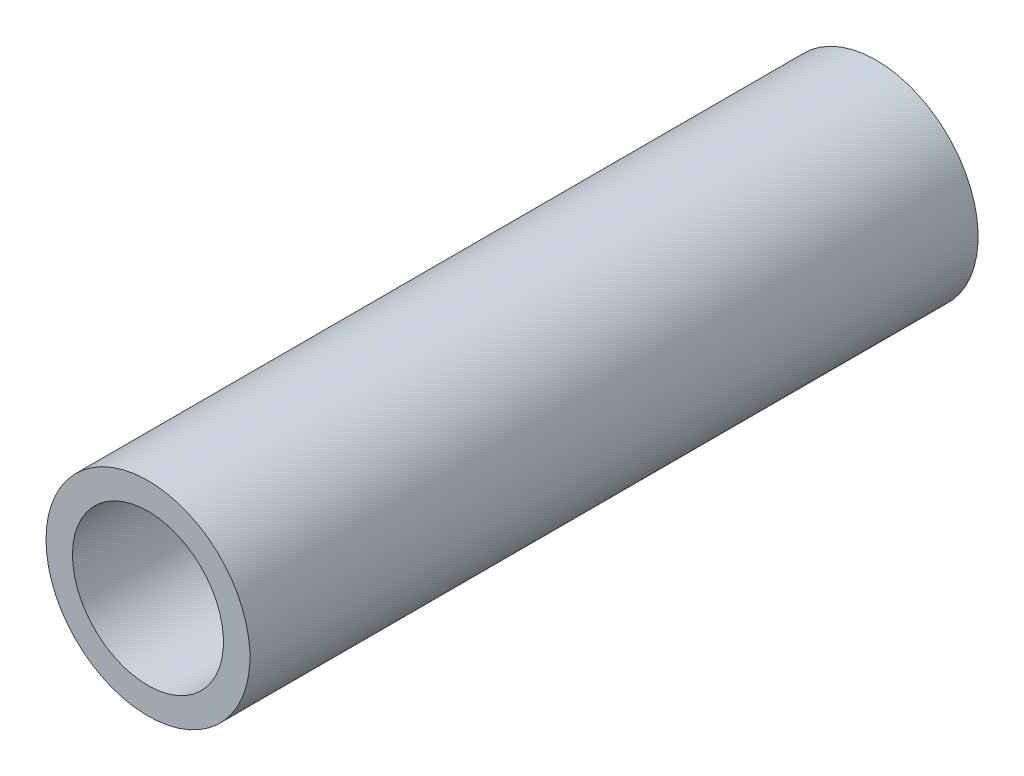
from build123d import *

# Parameters (mm, degrees)
SKETCH1_R      = 10.668
SKETCH1_R_2    = 7.8994
EXTRUDE1_DEPTH = 76.2


with BuildPart() as part:
    # Sketch1 → Extrude1 (new body)
    with BuildSketch(Plane.XY):
        with Locations(Location((0, 0, 0), (0, 0, 180))):
            Circle(SKETCH1_R)
        with Locations(Location((0, 0, 0), (0, 0, 180))):
            Circle(SKETCH1_R_2, mode=Mode.SUBTRACT)
    extrude(amount=EXTRUDE1_DEPTH)


solid = part.part
